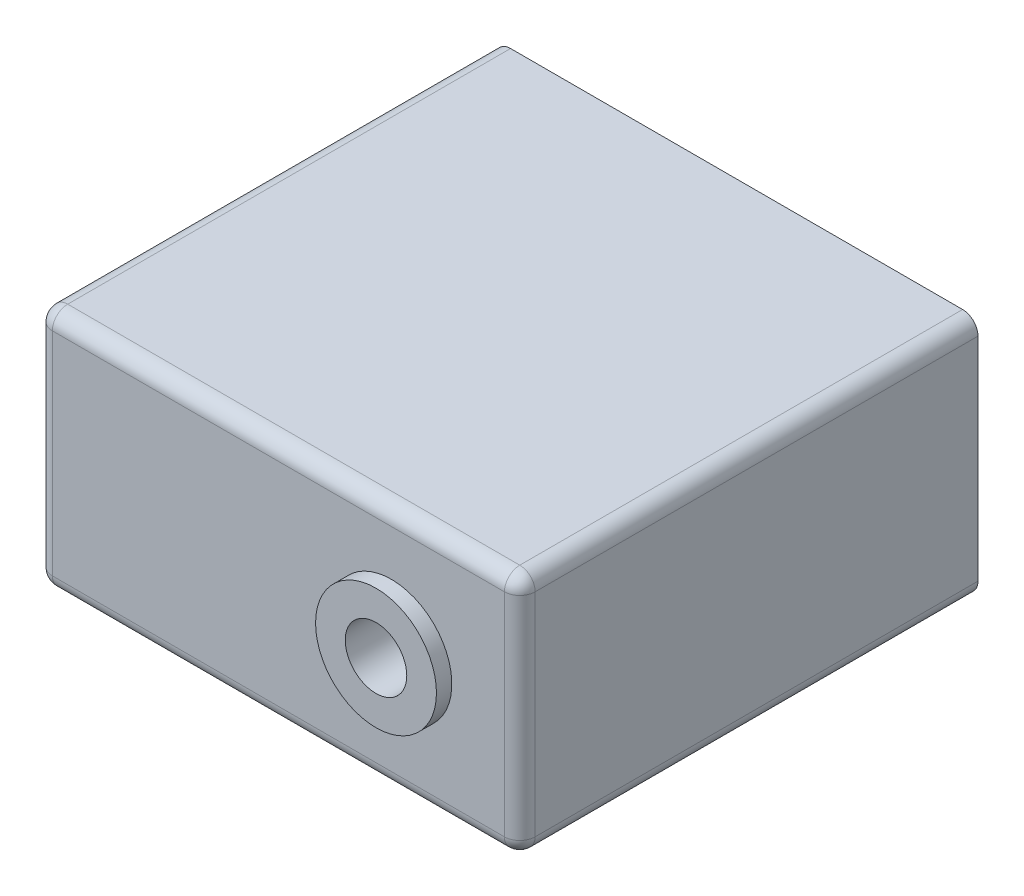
from build123d import *

# Parameters (mm, degrees)
SKETCH2_W           = 39.878
SKETCH2_H           = 20.066
BOSS_EXTRUDE1_DEPTH = 37.846
FILLET1_R           = 1.27
SKETCH3_R           = 4.991181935
BOSS_EXTRUDE2_DEPTH = 1.27
SKETCH4_R           = 2.54
CUT_EXTRUDE1_DEPTH  = 5.08


with BuildPart() as part:
    # Sketch2 → Boss-Extrude1 (new body)
    with BuildSketch(Plane.XY):
        with Locations((19.939, 10.033)):
            Rectangle(SKETCH2_W, SKETCH2_H)
    extrude(amount=BOSS_EXTRUDE1_DEPTH)

    # Fillet1
    fillet1_edges = [part.edges().sort_by_distance(p)[0] for p in [
        (39.878, 10.033, 37.846),
        (19.939, 20.066, 37.846),
        (0, 10.033, 37.846),
        (0, 20.066, 18.923),
        (39.878, 20.066, 18.923),
        (39.878, 0, 18.923),
        (0, 0, 18.923),
        (19.939, 0, 37.846),
    ]]
    fillet(fillet1_edges, radius=FILLET1_R)

    # Sketch3 → Boss-Extrude2 (add)
    with BuildSketch(Plane.XY.offset(37.846)):
        with Locations(Location((29.2735, 10.033, 0), (0, 0, 180))):
            Circle(SKETCH3_R)
    extrude(amount=BOSS_EXTRUDE2_DEPTH)

    # Sketch4 → Cut-Extrude1 (cut)
    with BuildSketch(Plane.XY.offset(39.116)):
        with Locations((29.2735, 10.033)):
            Circle(SKETCH4_R)
    extrude(amount=-CUT_EXTRUDE1_DEPTH, mode=Mode.SUBTRACT)


solid = part.part
